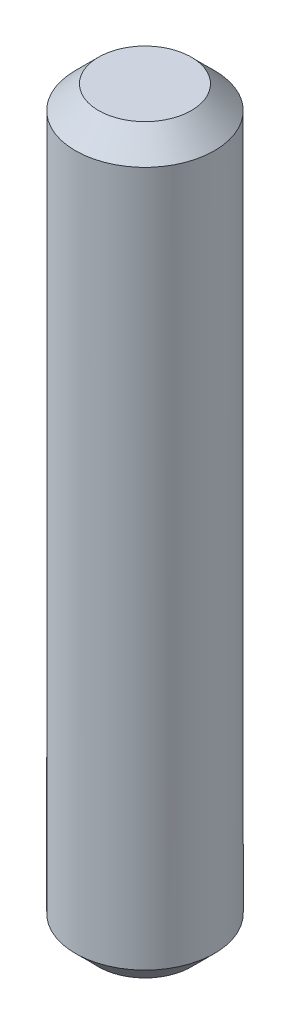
from build123d import *

# Parameters (mm, degrees)
SKETCH1_W     = 0.75
SKETCH1_H     = 8
CHAMFER1_SIZE = 0.25


with BuildPart() as part:
    # Sketch1 → Revolve1 (revolve)
    with BuildSketch(Plane.XY, mode=Mode.PRIVATE) as revolve1_sk:
        with Locations((0.375, 4)):
            Rectangle(SKETCH1_W, SKETCH1_H)
    revolve(revolve1_sk.sketch.rotate(Axis((0, 14.134029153, 0), (0, -1, 0)), 180), axis=Axis((0, 14.134029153, 0), (0, -1, 0)))

    # Chamfer1
    chamfer1_edges = [part.edges().sort_by_distance(p)[0] for p in [
        (0.75, 8, 0),
        (0.75, 0, 0),
    ]]
    chamfer(chamfer1_edges, length=CHAMFER1_SIZE)


solid = part.part
